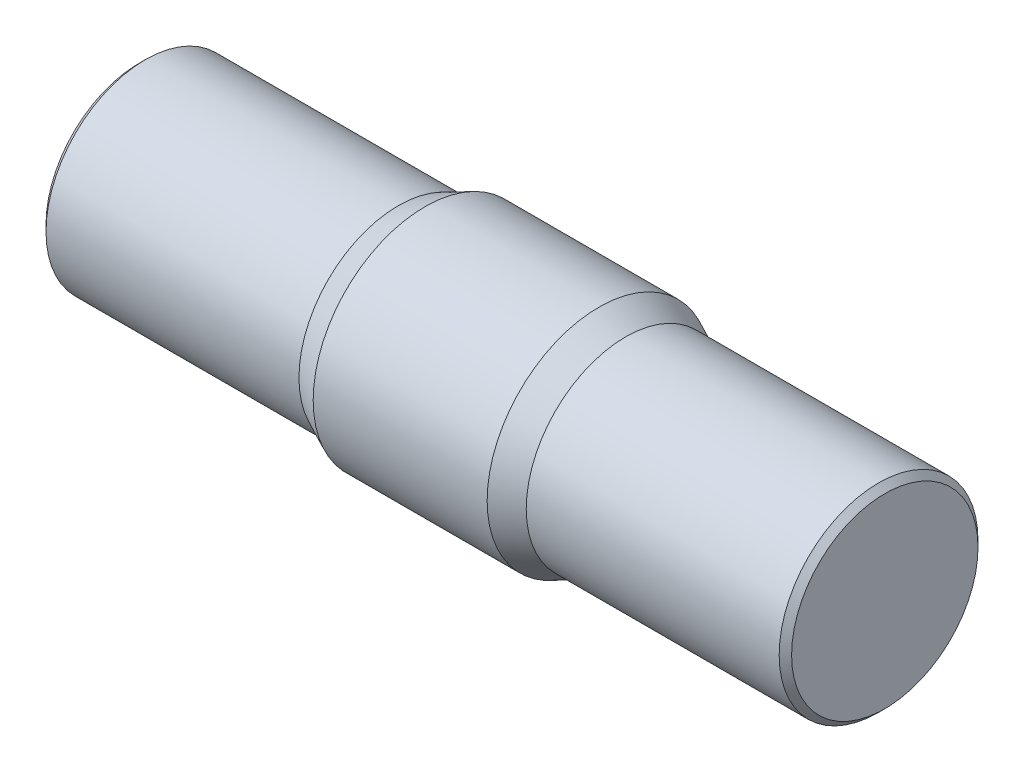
from build123d import *

# Parameters (mm, degrees)
CHANFREIN1_SIZE = 0.5


with BuildPart() as part:
    # Esquisse1 → R_volution1 (revolve)
    with BuildSketch(Plane.XY, mode=Mode.PRIVATE) as r_volution1_sk:
        Polygon((0, 0), (0, 8), (20.855493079, 8), (23, 9), (37, 9), (39.144506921, 8), (60, 8), (60, 0), align=None)
    revolve(r_volution1_sk.sketch.rotate(Axis((0, 0, 0), (1, 0, 0)), 90), axis=Axis((0, 0, 0), (1, 0, 0)))

    # Chanfrein1
    chanfrein1_edges = [part.edges().sort_by_distance(p)[0] for p in [
        (60, 0, -8),
        (0, 0, -8),
    ]]
    chamfer(chanfrein1_edges, length=CHANFREIN1_SIZE)


solid = part.part
